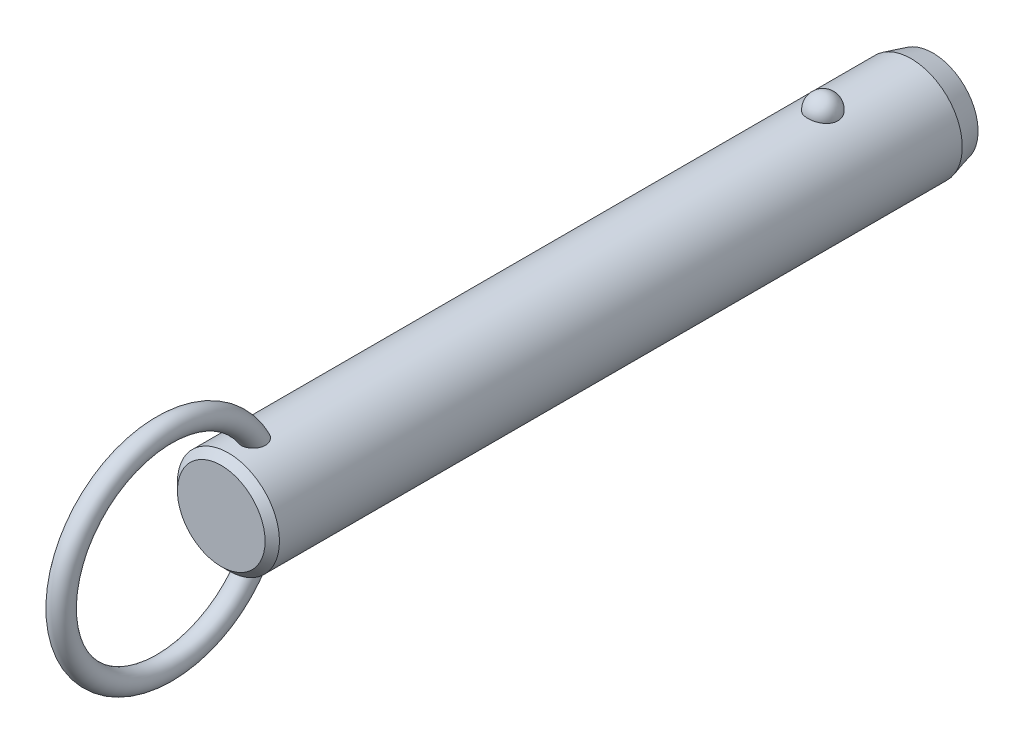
ISO-10303-21;
HEADER;
FILE_DESCRIPTION(('STEP AP214'),'2;1');
FILE_NAME('part.step','',(''),(''),'','','');
FILE_SCHEMA(('AUTOMOTIVE_DESIGN { 1 0 10303 214 1 1 1 1 }'));
ENDSEC;
DATA;
#1=APPLICATION_CONTEXT('core data for automotive mechanical design processes');
#2=APPLICATION_PROTOCOL_DEFINITION('international standard','automotive_design',2000,#1);
#3=PRODUCT_CONTEXT('',#1,'mechanical');
#4=PRODUCT('Part','Part','',(#3));
#5=PRODUCT_RELATED_PRODUCT_CATEGORY('part','',(#4));
#6=PRODUCT_DEFINITION_FORMATION('','',#4);
#7=PRODUCT_DEFINITION_CONTEXT('part definition',#1,'design');
#8=PRODUCT_DEFINITION('design','',#6,#7);
#9=PRODUCT_DEFINITION_SHAPE('','',#8);
#10=(LENGTH_UNIT() NAMED_UNIT(*) SI_UNIT(.MILLI.,.METRE.));
#11=(NAMED_UNIT(*) PLANE_ANGLE_UNIT() SI_UNIT($,.RADIAN.));
#12=(NAMED_UNIT(*) SI_UNIT($,.STERADIAN.) SOLID_ANGLE_UNIT());
#13=UNCERTAINTY_MEASURE_WITH_UNIT(LENGTH_MEASURE(1.E-05),#10,'distance_accuracy_value','');
#14=(GEOMETRIC_REPRESENTATION_CONTEXT(3) GLOBAL_UNCERTAINTY_ASSIGNED_CONTEXT((#13)) GLOBAL_UNIT_ASSIGNED_CONTEXT((#10,
#11,#12)) REPRESENTATION_CONTEXT('',''));
#15=CARTESIAN_POINT('',(0.,0.,0.));
#16=DIRECTION('',(0.,0.,1.));
#17=DIRECTION('',(1.,0.,0.));
#18=AXIS2_PLACEMENT_3D('',#15,#16,#17);
#19=CARTESIAN_POINT('',(0.,0.,73.7));
#20=DIRECTION('',(0.,0.,-1.));
#21=DIRECTION('',(-1.,0.,0.));
#22=AXIS2_PLACEMENT_3D('',#19,#20,#21);
#23=CYLINDRICAL_SURFACE('',#22,7.1);
#24=CARTESIAN_POINT('',(2.0769088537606,6.78943661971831,-2.1));
#25=CARTESIAN_POINT('',(2.07690739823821,6.78943796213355,-1.98268154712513));
#26=CARTESIAN_POINT('',(2.06738130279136,6.79237331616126,-1.86534506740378));
#27=CARTESIAN_POINT('',(2.0295040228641,6.8037853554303,-1.63400788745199));
#28=CARTESIAN_POINT('',(2.00114757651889,6.81226358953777,-1.52000812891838));
#29=CARTESIAN_POINT('',(1.92632025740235,6.83379798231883,-1.29863433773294));
#30=CARTESIAN_POINT('',(1.87985726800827,6.84685214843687,-1.19125744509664));
#31=CARTESIAN_POINT('',(1.76995205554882,6.87608091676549,-0.98604657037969));
#32=CARTESIAN_POINT('',(1.70650980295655,6.8922555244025,-0.88821260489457));
#33=CARTESIAN_POINT('',(1.5638119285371,6.92602930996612,-0.704242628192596));
#34=CARTESIAN_POINT('',(1.4844714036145,6.94363582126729,-0.618173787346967));
#35=CARTESIAN_POINT('',(1.31221746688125,6.97823658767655,-0.460740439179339));
#36=CARTESIAN_POINT('',(1.21930409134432,6.99523084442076,-0.389375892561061));
#37=CARTESIAN_POINT('',(1.02268781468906,7.02666176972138,-0.263547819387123));
#38=CARTESIAN_POINT('',(0.91902009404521,7.04110638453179,-0.209031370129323));
#39=CARTESIAN_POINT('',(0.703548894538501,7.06588726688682,-0.118163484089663));
#40=CARTESIAN_POINT('',(0.591746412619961,7.07622403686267,-0.0818098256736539));
#41=CARTESIAN_POINT('',(0.365557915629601,7.09147068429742,-0.0288711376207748));
#42=CARTESIAN_POINT('',(0.251267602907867,7.09648447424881,-0.0119070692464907));
#43=CARTESIAN_POINT('',(0.0213499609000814,7.10089837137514,0.00304925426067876));
#44=CARTESIAN_POINT('',(-0.0942772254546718,7.10029907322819,0.00104351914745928));
#45=CARTESIAN_POINT('',(-0.321651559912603,7.09360829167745,-0.0216931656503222));
#46=CARTESIAN_POINT('',(-0.433431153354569,7.08760388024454,-0.0421272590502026));
#47=CARTESIAN_POINT('',(-0.651862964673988,7.07086131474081,-0.100729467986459));
#48=CARTESIAN_POINT('',(-0.758515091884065,7.06012307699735,-0.138897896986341));
#49=CARTESIAN_POINT('',(-0.964449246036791,7.03496097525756,-0.232213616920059));
#50=CARTESIAN_POINT('',(-1.06368095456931,7.02051445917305,-0.287465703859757));
#51=CARTESIAN_POINT('',(-1.25145353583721,6.98948740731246,-0.413383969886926));
#52=CARTESIAN_POINT('',(-1.33999321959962,6.97290663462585,-0.48405186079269));
#53=CARTESIAN_POINT('',(-1.50591604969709,6.93898770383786,-0.640594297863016));
#54=CARTESIAN_POINT('',(-1.58302488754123,6.92164094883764,-0.726757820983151));
#55=CARTESIAN_POINT('',(-1.72189320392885,6.8884103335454,-0.91092752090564));
#56=CARTESIAN_POINT('',(-1.78365144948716,6.87252659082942,-1.008934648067));
#57=CARTESIAN_POINT('',(-1.89101272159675,6.84377189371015,-1.21549497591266));
#58=CARTESIAN_POINT('',(-1.93639553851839,6.83094274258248,-1.32416860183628));
#59=CARTESIAN_POINT('',(-2.00874275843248,6.81002070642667,-1.54791500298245));
#60=CARTESIAN_POINT('',(-2.03570774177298,6.80192767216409,-1.66298757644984));
#61=CARTESIAN_POINT('',(-2.07047276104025,6.7914266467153,-1.89571453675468));
#62=CARTESIAN_POINT('',(-2.07835878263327,6.78899315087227,-2.01335491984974));
#63=CARTESIAN_POINT('',(-2.07502083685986,6.79001409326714,-2.24833570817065));
#64=CARTESIAN_POINT('',(-2.06379746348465,6.7934683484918,-2.36567612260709));
#65=CARTESIAN_POINT('',(-2.02263913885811,6.80583442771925,-2.59603194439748));
#66=CARTESIAN_POINT('',(-1.99281127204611,6.81471501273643,-2.70906820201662));
#67=CARTESIAN_POINT('',(-1.91526639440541,6.83691232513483,-2.92836575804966));
#68=CARTESIAN_POINT('',(-1.8675486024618,6.85022924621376,-3.03462676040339));
#69=CARTESIAN_POINT('',(-1.75504492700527,6.87991336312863,-3.23806487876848));
#70=CARTESIAN_POINT('',(-1.69015924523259,6.89629822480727,-3.33518422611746));
#71=CARTESIAN_POINT('',(-1.54505404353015,6.93024852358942,-3.51697105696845));
#72=CARTESIAN_POINT('',(-1.46483385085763,6.94781401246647,-3.60163799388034));
#73=CARTESIAN_POINT('',(-1.29071406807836,6.98225977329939,-3.75654119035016));
#74=CARTESIAN_POINT('',(-1.19675650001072,6.99913673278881,-3.82671308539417));
#75=CARTESIAN_POINT('',(-0.997940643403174,7.03023618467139,-3.9501837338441));
#76=CARTESIAN_POINT('',(-0.89308318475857,7.04445887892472,-4.00348377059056));
#77=CARTESIAN_POINT('',(-0.676902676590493,7.06848365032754,-4.09107242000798));
#78=CARTESIAN_POINT('',(-0.565686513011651,7.0783430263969,-4.12560889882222));
#79=CARTESIAN_POINT('',(-0.338739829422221,7.09282534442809,-4.17575450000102));
#80=CARTESIAN_POINT('',(-0.223009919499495,7.09744899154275,-4.19136617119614));
#81=CARTESIAN_POINT('',(0.00707628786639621,7.10090930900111,-4.20307965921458));
#82=CARTESIAN_POINT('',(0.121410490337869,7.09986531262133,-4.19958377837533));
#83=CARTESIAN_POINT('',(0.347815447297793,7.092380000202,-4.17411564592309));
#84=CARTESIAN_POINT('',(0.459886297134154,7.08593891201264,-4.15214417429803));
#85=CARTESIAN_POINT('',(0.678084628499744,7.06838983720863,-4.09049562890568));
#86=CARTESIAN_POINT('',(0.784237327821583,7.05730369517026,-4.05090137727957));
#87=CARTESIAN_POINT('',(0.988305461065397,7.03163139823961,-3.95511447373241));
#88=CARTESIAN_POINT('',(1.08622031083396,7.01704499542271,-3.89892064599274));
#89=CARTESIAN_POINT('',(1.27284490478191,6.98562668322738,-3.77035541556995));
#90=CARTESIAN_POINT('',(1.36137372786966,6.96876135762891,-3.69772964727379));
#91=CARTESIAN_POINT('',(1.52509486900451,6.93477412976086,-3.53878279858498));
#92=CARTESIAN_POINT('',(1.60028496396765,6.91765218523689,-3.45245943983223));
#93=CARTESIAN_POINT('',(1.73681688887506,6.88465753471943,-3.26658774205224));
#94=CARTESIAN_POINT('',(1.79785966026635,6.86881574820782,-3.16681408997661));
#95=CARTESIAN_POINT('',(1.90265327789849,6.84053157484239,-2.95814408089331));
#96=CARTESIAN_POINT('',(1.94640861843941,6.82808830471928,-2.84925010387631));
#97=CARTESIAN_POINT('',(2.01274378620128,6.80881460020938,-2.63454318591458));
#98=CARTESIAN_POINT('',(2.03676193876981,6.80160856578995,-2.52920574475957));
#99=CARTESIAN_POINT('',(2.06884490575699,6.79191902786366,-2.3159172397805));
#100=CARTESIAN_POINT('',(2.07691019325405,6.78943538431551,-2.20796625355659));
#101=CARTESIAN_POINT('',(2.0769088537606,6.78943661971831,-2.1));
#102=B_SPLINE_CURVE_WITH_KNOTS('',3,(#24,#25,#26,#27,#28,#29,#30,#31,#32,#33,#34,#35,#36,#37,
#38,#39,#40,#41,#42,#43,#44,#45,#46,#47,#48,#49,#50,#51,#52,#53,#54,#55,#56,#57,#58,#59,#60,#61,
#62,#63,#64,#65,#66,#67,#68,#69,#70,#71,#72,#73,#74,#75,#76,#77,#78,#79,#80,#81,#82,#83,#84,#85,
#86,#87,#88,#89,#90,#91,#92,#93,#94,#95,#96,#97,#98,#99,#100,#101),.UNSPECIFIED.,.T.,.F.,(4,2,2,
2,2,2,2,2,2,2,2,2,2,2,2,2,2,2,2,2,2,2,2,2,2,2,2,2,2,2,2,2,2,2,2,2,2,2,4),(0.,0.351568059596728,
0.703234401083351,1.05474780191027,1.40626181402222,1.75970563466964,2.11314851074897,
2.4654696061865,2.81774759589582,3.16301449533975,3.50824481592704,3.84801136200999,
4.18778391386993,4.52968352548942,4.87162112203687,5.22076181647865,5.56993054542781,
5.92363364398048,6.27732559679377,6.62942052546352,6.98150450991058,7.33158042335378,
7.68167162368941,8.03384443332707,8.38603269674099,8.73975272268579,9.09344583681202,
9.44234545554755,9.79119807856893,10.1327344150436,10.4742563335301,10.8141898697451,
11.1541474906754,11.4997793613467,11.8454687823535,12.1979079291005,12.5502553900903,
12.8738073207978,13.1973496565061),.UNSPECIFIED.);
#103=CARTESIAN_POINT('',(2.0769088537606,6.78943661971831,-2.1));
#104=VERTEX_POINT('',#103);
#105=EDGE_CURVE('E41',#104,#104,#102,.T.);
#106=ORIENTED_EDGE('',*,*,#105,.T.);
#107=EDGE_LOOP('',(#106));
#108=FACE_BOUND('',#107,.T.);
#109=CARTESIAN_POINT('',(0.,0.,80.62));
#110=DIRECTION('',(0.,0.,1.));
#111=DIRECTION('',(1.,0.,0.));
#112=AXIS2_PLACEMENT_3D('',#109,#110,#111);
#113=CIRCLE('',#112,7.1);
#114=CARTESIAN_POINT('',(7.1,0.,80.62));
#115=VERTEX_POINT('',#114);
#116=EDGE_CURVE('E10',#115,#115,#113,.F.);
#117=ORIENTED_EDGE('',*,*,#116,.T.);
#118=EDGE_LOOP('',(#117));
#119=FACE_BOUND('',#118,.T.);
#120=CARTESIAN_POINT('',(-0.429539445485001,-7.08699541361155,75.4429212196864));
#121=CARTESIAN_POINT('',(-0.508331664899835,-7.08221999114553,75.4668764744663));
#122=CARTESIAN_POINT('',(-0.585039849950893,-7.07624016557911,75.4974570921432));
#123=CARTESIAN_POINT('',(-0.732082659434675,-7.06254296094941,75.5710242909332));
#124=CARTESIAN_POINT('',(-0.802417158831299,-7.05482554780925,75.6140111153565));
#125=CARTESIAN_POINT('',(-0.934722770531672,-7.03851844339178,75.7111135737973));
#126=CARTESIAN_POINT('',(-0.996700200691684,-7.02992941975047,75.7652207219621));
#127=CARTESIAN_POINT('',(-1.11079942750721,-7.01280697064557,75.8829676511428));
#128=CARTESIAN_POINT('',(-1.16292136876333,-7.00427354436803,75.9466072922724));
#129=CARTESIAN_POINT('',(-1.25705660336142,-6.98799959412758,76.0826870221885));
#130=CARTESIAN_POINT('',(-1.2988803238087,-6.98027525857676,76.1552598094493));
#131=CARTESIAN_POINT('',(-1.37069920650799,-6.96652886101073,76.3061686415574));
#132=CARTESIAN_POINT('',(-1.40069157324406,-6.96050720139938,76.3845060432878));
#133=CARTESIAN_POINT('',(-1.45043507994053,-6.95031881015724,76.5501903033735));
#134=CARTESIAN_POINT('',(-1.46937115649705,-6.94630231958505,76.6377897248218));
#135=CARTESIAN_POINT('',(-1.49424917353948,-6.94099239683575,76.8148714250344));
#136=CARTESIAN_POINT('',(-1.50018601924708,-6.93970003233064,76.9043544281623));
#137=CARTESIAN_POINT('',(-1.49978214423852,-6.93978815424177,77.0940607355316));
#138=CARTESIAN_POINT('',(-1.49187639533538,-6.94150934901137,77.194279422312));
#139=CARTESIAN_POINT('',(-1.46177925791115,-6.94790814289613,77.3924798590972));
#140=CARTESIAN_POINT('',(-1.43957541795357,-6.95258831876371,77.490459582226));
#141=CARTESIAN_POINT('',(-1.37783293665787,-6.96510647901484,77.6953629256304));
#142=CARTESIAN_POINT('',(-1.33634073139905,-6.97328848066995,77.8016801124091));
#143=CARTESIAN_POINT('',(-1.23686994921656,-6.99161706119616,78.0061777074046));
#144=CARTESIAN_POINT('',(-1.17889192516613,-7.00176357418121,78.1043583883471));
#145=CARTESIAN_POINT('',(-1.0587512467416,-7.02082898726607,78.2723743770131));
#146=CARTESIAN_POINT('',(-0.999247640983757,-7.02963746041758,78.3441230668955));
#147=CARTESIAN_POINT('',(-0.869494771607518,-7.04686074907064,78.4771959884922));
#148=CARTESIAN_POINT('',(-0.79926347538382,-7.05527619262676,78.5385372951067));
#149=CARTESIAN_POINT('',(-0.665408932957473,-7.06899457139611,78.6351316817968));
#150=CARTESIAN_POINT('',(-0.603817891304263,-7.07457275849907,78.6731512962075));
#151=CARTESIAN_POINT('',(-0.475172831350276,-7.08437420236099,78.7387581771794));
#152=CARTESIAN_POINT('',(-0.408123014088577,-7.08859848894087,78.7663533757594));
#153=CARTESIAN_POINT('',(-0.269431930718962,-7.09522749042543,78.8092569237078));
#154=CARTESIAN_POINT('',(-0.197757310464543,-7.09761688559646,78.8244618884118));
#155=CARTESIAN_POINT('',(-0.0527849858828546,-7.10017268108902,78.8407168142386));
#156=CARTESIAN_POINT('',(0.0205115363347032,-7.10034065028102,78.8417767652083));
#157=CARTESIAN_POINT('',(0.156426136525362,-7.09855986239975,78.8304619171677));
#158=CARTESIAN_POINT('',(0.219199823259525,-7.09688191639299,78.8198060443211));
#159=CARTESIAN_POINT('',(0.342134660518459,-7.09201880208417,78.7885379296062));
#160=CARTESIAN_POINT('',(0.402295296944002,-7.08883333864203,78.7679237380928));
#161=CARTESIAN_POINT('',(0.52068738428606,-7.08113868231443,78.7172125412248));
#162=CARTESIAN_POINT('',(0.578791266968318,-7.07658958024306,78.6868272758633));
#163=CARTESIAN_POINT('',(0.690173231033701,-7.06659708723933,78.6183678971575));
#164=CARTESIAN_POINT('',(0.743447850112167,-7.061153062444,78.5802883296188));
#165=CARTESIAN_POINT('',(0.870947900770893,-7.04680292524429,78.4765929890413));
#166=CARTESIAN_POINT('',(0.941828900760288,-7.0375580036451,78.4068972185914));
#167=CARTESIAN_POINT('',(1.07136606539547,-7.01900793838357,78.2569450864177));
#168=CARTESIAN_POINT('',(1.13000013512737,-7.00970271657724,78.1766700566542));
#169=CARTESIAN_POINT('',(1.23579584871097,-6.99183327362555,78.0068997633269));
#170=CARTESIAN_POINT('',(1.28274271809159,-6.98328455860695,77.9172696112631));
#171=CARTESIAN_POINT('',(1.36351442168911,-6.96796352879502,77.7321763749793));
#172=CARTESIAN_POINT('',(1.39733971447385,-6.96119115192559,77.6367134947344));
#173=CARTESIAN_POINT('',(1.45579181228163,-6.94922464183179,77.4253092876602));
#174=CARTESIAN_POINT('',(1.47790145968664,-6.94449000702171,77.308631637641));
#175=CARTESIAN_POINT('',(1.50168752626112,-6.93938731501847,77.0730153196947));
#176=CARTESIAN_POINT('',(1.50336085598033,-6.93901991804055,76.95407631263));
#177=CARTESIAN_POINT('',(1.48486516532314,-6.9430010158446,76.7236079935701));
#178=CARTESIAN_POINT('',(1.46573441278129,-6.9471253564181,76.6119958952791));
#179=CARTESIAN_POINT('',(1.40606892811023,-6.95944667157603,76.3948868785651));
#180=CARTESIAN_POINT('',(1.3655644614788,-6.96763788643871,76.2893815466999));
#181=CARTESIAN_POINT('',(1.27082700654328,-6.98548038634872,76.1042879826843));
#182=CARTESIAN_POINT('',(1.21949810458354,-6.99473841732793,76.0231719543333));
#183=CARTESIAN_POINT('',(1.10242050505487,-7.01414069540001,75.8722278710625));
#184=CARTESIAN_POINT('',(1.03668119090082,-7.02428436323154,75.8023925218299));
#185=CARTESIAN_POINT('',(0.900559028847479,-7.04295285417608,75.6835735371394));
#186=CARTESIAN_POINT('',(0.831428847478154,-7.05153466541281,75.6331573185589));
#187=CARTESIAN_POINT('',(0.685291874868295,-7.06723150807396,75.5451429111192));
#188=CARTESIAN_POINT('',(0.608287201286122,-7.0743469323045,75.5075412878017));
#189=CARTESIAN_POINT('',(0.451878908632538,-7.08602232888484,75.4474915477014));
#190=CARTESIAN_POINT('',(0.372686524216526,-7.09067127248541,75.4245088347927));
#191=CARTESIAN_POINT('',(0.211477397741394,-7.09730788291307,75.3920357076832));
#192=CARTESIAN_POINT('',(0.12946098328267,-7.09929585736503,75.3825437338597));
#193=CARTESIAN_POINT('',(-0.0332905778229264,-7.10037858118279,75.3773517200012));
#194=CARTESIAN_POINT('',(-0.114016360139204,-7.09953334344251,75.3813656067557));
#195=CARTESIAN_POINT('',(-0.273670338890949,-7.09517338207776,75.4024540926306));
#196=CARTESIAN_POINT('',(-0.352598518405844,-7.09165863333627,75.4195288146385));
#197=CARTESIAN_POINT('',(-0.429539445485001,-7.08699541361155,75.4429212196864));
#198=B_SPLINE_CURVE_WITH_KNOTS('',3,(#120,#121,#122,#123,#124,#125,#126,#127,#128,#129,#130,
#131,#132,#133,#134,#135,#136,#137,#138,#139,#140,#141,#142,#143,#144,#145,#146,#147,#148,#149,
#150,#151,#152,#153,#154,#155,#156,#157,#158,#159,#160,#161,#162,#163,#164,#165,#166,#167,#168,
#169,#170,#171,#172,#173,#174,#175,#176,#177,#178,#179,#180,#181,#182,#183,#184,#185,#186,#187,
#188,#189,#190,#191,#192,#193,#194,#195,#196,#197),.UNSPECIFIED.,.T.,.F.,(4,2,2,2,2,2,2,2,2,2,2,
2,2,2,2,2,2,2,2,2,2,2,2,2,2,2,2,2,2,2,2,2,2,2,2,2,2,2,4),(0.,0.247183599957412,0.49437204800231,
0.741372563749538,0.988369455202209,1.23962059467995,1.49093106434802,1.75897818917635,
2.02713035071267,2.32758265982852,2.62829697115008,2.97008736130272,3.31186629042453,
3.5917531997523,3.87117637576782,4.08813841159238,4.30493502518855,4.52352259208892,
4.74195577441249,4.93215328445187,5.12238804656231,5.31884850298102,5.51544871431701,
5.81332317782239,6.11173048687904,6.41527266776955,6.71880423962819,7.07358156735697,
7.42841252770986,7.76631485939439,8.10373999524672,8.39142246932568,8.67891817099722,
8.93560332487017,9.19221962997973,9.43881106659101,9.68537399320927,9.92674752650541,
10.1681233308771),.UNSPECIFIED.);
#199=CARTESIAN_POINT('',(-0.429539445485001,-7.08699541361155,75.4429212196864));
#200=VERTEX_POINT('',#199);
#201=EDGE_CURVE('E60',#200,#200,#198,.T.);
#202=ORIENTED_EDGE('',*,*,#201,.T.);
#203=EDGE_LOOP('',(#202));
#204=FACE_BOUND('',#203,.T.);
#205=CARTESIAN_POINT('',(-0.429539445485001,7.08699541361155,75.4429212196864));
#206=CARTESIAN_POINT('',(-0.351665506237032,7.09171429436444,75.4192469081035));
#207=CARTESIAN_POINT('',(-0.271733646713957,7.09525896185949,75.4020369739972));
#208=CARTESIAN_POINT('',(-0.110026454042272,7.09960839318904,75.3810059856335));
#209=CARTESIAN_POINT('',(-0.0282502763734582,7.10041187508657,75.377191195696));
#210=CARTESIAN_POINT('',(0.134782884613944,7.09918849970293,75.383059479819));
#211=CARTESIAN_POINT('',(0.216039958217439,7.09716214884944,75.3927401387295));
#212=CARTESIAN_POINT('',(0.375730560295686,7.09050177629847,75.4253471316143));
#213=CARTESIAN_POINT('',(0.454164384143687,7.08586802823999,75.4482720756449));
#214=CARTESIAN_POINT('',(0.606025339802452,7.07449911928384,75.506771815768));
#215=CARTESIAN_POINT('',(0.679451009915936,7.06776334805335,75.5423502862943));
#216=CARTESIAN_POINT('',(0.819234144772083,7.05292866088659,75.6251753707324));
#217=CARTESIAN_POINT('',(0.885591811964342,7.04482978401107,75.6724216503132));
#218=CARTESIAN_POINT('',(1.00993211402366,7.02808709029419,75.7775902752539));
#219=CARTESIAN_POINT('',(1.06785399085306,7.01943990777,75.835583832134));
#220=CARTESIAN_POINT('',(1.17342527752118,7.00256662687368,75.9603013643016));
#221=CARTESIAN_POINT('',(1.22107408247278,6.99434055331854,76.0270258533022));
#222=CARTESIAN_POINT('',(1.30652927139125,6.97889183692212,76.1693622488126));
#223=CARTESIAN_POINT('',(1.34399711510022,6.97170674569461,76.2451808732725));
#224=CARTESIAN_POINT('',(1.40682616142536,6.95930080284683,76.4018100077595));
#225=CARTESIAN_POINT('',(1.43218374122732,6.95408053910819,76.4826220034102));
#226=CARTESIAN_POINT('',(1.47246409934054,6.94566853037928,76.6535314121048));
#227=CARTESIAN_POINT('',(1.48642590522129,6.9426653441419,76.7438630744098));
#228=CARTESIAN_POINT('',(1.5011410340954,6.93949744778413,76.925619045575));
#229=CARTESIAN_POINT('',(1.50188917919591,6.93933385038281,77.0170437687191));
#230=CARTESIAN_POINT('',(1.49030464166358,6.94183245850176,77.2108438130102));
#231=CARTESIAN_POINT('',(1.47627413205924,6.94486147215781,77.313112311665));
#232=CARTESIAN_POINT('',(1.43356351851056,6.95380194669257,77.5144719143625));
#233=CARTESIAN_POINT('',(1.4048676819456,6.95971650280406,77.6135594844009));
#234=CARTESIAN_POINT('',(1.32908750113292,6.97461208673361,77.8189087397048));
#235=CARTESIAN_POINT('',(1.28011435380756,6.98388945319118,77.9244566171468));
#236=CARTESIAN_POINT('',(1.16520357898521,7.00397743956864,78.1257604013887));
#237=CARTESIAN_POINT('',(1.09927694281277,7.01478706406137,78.2215225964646));
#238=CARTESIAN_POINT('',(0.969361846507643,7.03373936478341,78.3767565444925));
#239=CARTESIAN_POINT('',(0.909042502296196,7.04187023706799,78.4393032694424));
#240=CARTESIAN_POINT('',(0.779178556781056,7.05741732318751,78.5540535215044));
#241=CARTESIAN_POINT('',(0.709649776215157,7.06483472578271,78.6062744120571));
#242=CARTESIAN_POINT('',(0.576854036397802,7.0767751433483,78.6881138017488));
#243=CARTESIAN_POINT('',(0.515118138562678,7.08158033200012,78.7201641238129));
#244=CARTESIAN_POINT('',(0.387127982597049,7.08972701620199,78.7737656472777));
#245=CARTESIAN_POINT('',(0.320877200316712,7.09306962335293,78.7953248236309));
#246=CARTESIAN_POINT('',(0.185041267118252,7.09791507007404,78.8264005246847));
#247=CARTESIAN_POINT('',(0.115437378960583,7.09940591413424,78.8358385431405));
#248=CARTESIAN_POINT('',(-0.0243157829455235,7.10030171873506,78.8415226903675));
#249=CARTESIAN_POINT('',(-0.0944648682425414,7.0997073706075,78.8377731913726));
#250=CARTESIAN_POINT('',(-0.225713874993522,7.09668414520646,78.8185081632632));
#251=CARTESIAN_POINT('',(-0.28700675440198,7.09444865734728,78.8042323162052));
#252=CARTESIAN_POINT('',(-0.406555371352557,7.08860360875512,78.7663685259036));
#253=CARTESIAN_POINT('',(-0.464809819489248,7.08499346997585,78.7427766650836));
#254=CARTESIAN_POINT('',(-0.594955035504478,7.07541654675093,78.6789232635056));
#255=CARTESIAN_POINT('',(-0.665389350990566,7.06906574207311,78.635753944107));
#256=CARTESIAN_POINT('',(-0.798242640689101,7.05530261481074,78.538587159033));
#257=CARTESIAN_POINT('',(-0.860645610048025,7.0478882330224,78.4845686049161));
#258=CARTESIAN_POINT('',(-0.994249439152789,7.03045217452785,78.3509965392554));
#259=CARTESIAN_POINT('',(-1.06260129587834,7.02030745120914,78.2686143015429));
#260=CARTESIAN_POINT('',(-1.18502045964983,7.00068382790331,78.093843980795));
#261=CARTESIAN_POINT('',(-1.23907684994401,6.99120544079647,78.001448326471));
#262=CARTESIAN_POINT('',(-1.33335589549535,6.97384343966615,77.8080085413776));
#263=CARTESIAN_POINT('',(-1.3733613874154,6.96598557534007,77.7068564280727));
#264=CARTESIAN_POINT('',(-1.43770677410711,6.9529905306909,77.4995046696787));
#265=CARTESIAN_POINT('',(-1.46204473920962,6.94785368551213,77.39330440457));
#266=CARTESIAN_POINT('',(-1.49537533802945,6.94076296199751,77.1682317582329));
#267=CARTESIAN_POINT('',(-1.50273564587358,6.93914842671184,77.0490975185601));
#268=CARTESIAN_POINT('',(-1.4954555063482,6.94072368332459,76.8114703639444));
#269=CARTESIAN_POINT('',(-1.48082914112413,6.94391040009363,76.6929770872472));
#270=CARTESIAN_POINT('',(-1.43076401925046,6.95438579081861,76.4734325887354));
#271=CARTESIAN_POINT('',(-1.39762227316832,6.96121852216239,76.3718413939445));
#272=CARTESIAN_POINT('',(-1.31211274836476,6.97783941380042,76.1773513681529));
#273=CARTESIAN_POINT('',(-1.2597660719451,6.98762432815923,76.0844431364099));
#274=CARTESIAN_POINT('',(-1.14583073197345,7.00713153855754,75.9241601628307));
#275=CARTESIAN_POINT('',(-1.08665947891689,7.01665982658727,75.8550351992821));
#276=CARTESIAN_POINT('',(-0.956606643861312,7.03556646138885,75.7288786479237));
#277=CARTESIAN_POINT('',(-0.885737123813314,7.04494495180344,75.6718347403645));
#278=CARTESIAN_POINT('',(-0.751558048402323,7.06035735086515,75.5831004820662));
#279=CARTESIAN_POINT('',(-0.690120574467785,7.0666695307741,75.5485932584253));
#280=CARTESIAN_POINT('',(-0.562815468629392,7.07794609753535,75.4887507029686));
#281=CARTESIAN_POINT('',(-0.496948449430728,7.08291067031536,75.4634141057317));
#282=CARTESIAN_POINT('',(-0.429539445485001,7.08699541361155,75.4429212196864));
#283=B_SPLINE_CURVE_WITH_KNOTS('',3,(#205,#206,#207,#208,#209,#210,#211,#212,#213,#214,#215,
#216,#217,#218,#219,#220,#221,#222,#223,#224,#225,#226,#227,#228,#229,#230,#231,#232,#233,#234,
#235,#236,#237,#238,#239,#240,#241,#242,#243,#244,#245,#246,#247,#248,#249,#250,#251,#252,#253,
#254,#255,#256,#257,#258,#259,#260,#261,#262,#263,#264,#265,#266,#267,#268,#269,#270,#271,#272,
#273,#274,#275,#276,#277,#278,#279,#280,#281,#282),.UNSPECIFIED.,.T.,.F.,(4,2,2,2,2,2,2,2,2,2,2,
2,2,2,2,2,2,2,2,2,2,2,2,2,2,2,2,2,2,2,2,2,2,2,2,2,2,2,4),(0.,0.244335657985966,
0.488785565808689,0.733191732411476,0.977572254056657,1.22202379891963,1.46646834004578,
1.71259457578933,1.95873529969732,2.21226768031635,2.46587585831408,2.73913816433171,
3.01250754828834,3.32109936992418,3.63002293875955,3.97863512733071,4.32702187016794,
4.58793945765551,4.84841449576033,5.05676704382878,5.26496096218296,5.47449661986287,
5.68396281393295,5.87205447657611,6.06022532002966,6.30743751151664,6.55513496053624,
6.87602468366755,7.19715875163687,7.52305774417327,7.84899686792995,8.20516155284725,
8.56109821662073,8.88040084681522,9.19935367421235,9.47236282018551,9.74509220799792,
9.9566225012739,10.1681235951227),.UNSPECIFIED.);
#284=CARTESIAN_POINT('',(-0.429539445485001,7.08699541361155,75.4429212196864));
#285=VERTEX_POINT('',#284);
#286=EDGE_CURVE('E67',#285,#285,#283,.T.);
#287=ORIENTED_EDGE('',*,*,#286,.T.);
#288=EDGE_LOOP('',(#287));
#289=FACE_BOUND('',#288,.T.);
#290=CARTESIAN_POINT('',(0.,0.,-14.4));
#291=DIRECTION('',(0.,0.,-1.));
#292=DIRECTION('',(-1.,0.,0.));
#293=AXIS2_PLACEMENT_3D('',#290,#291,#292);
#294=CIRCLE('',#293,7.1);
#295=CARTESIAN_POINT('',(-7.1,0.,-14.4));
#296=VERTEX_POINT('',#295);
#297=EDGE_CURVE('E57',#296,#296,#294,.F.);
#298=ORIENTED_EDGE('',*,*,#297,.T.);
#299=EDGE_LOOP('',(#298));
#300=FACE_BOUND('',#299,.T.);
#301=ADVANCED_FACE('F37',(#108,#119,#204,#289,#300),#23,.T.);
#302=CARTESIAN_POINT('',(0.,0.,-17.4));
#303=DIRECTION('',(0.,0.,-1.));
#304=DIRECTION('',(-1.,0.,0.));
#305=AXIS2_PLACEMENT_3D('',#302,#303,#304);
#306=PLANE('',#305);
#307=CARTESIAN_POINT('',(0.,0.,-17.4));
#308=DIRECTION('',(0.,0.,-1.));
#309=DIRECTION('',(-1.,0.,0.));
#310=AXIS2_PLACEMENT_3D('',#307,#308,#309);
#311=CIRCLE('',#310,6.29615242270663);
#312=CARTESIAN_POINT('',(-6.29615242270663,0.,-17.4));
#313=VERTEX_POINT('',#312);
#314=EDGE_CURVE('E66',#313,#313,#311,.T.);
#315=ORIENTED_EDGE('',*,*,#314,.T.);
#316=EDGE_LOOP('',(#315));
#317=FACE_BOUND('',#316,.T.);
#318=ADVANCED_FACE('F85',(#317),#306,.T.);
#319=CARTESIAN_POINT('',(0.,0.,-17.4));
#320=DIRECTION('',(0.,0.,1.));
#321=DIRECTION('',(1.,0.,0.));
#322=AXIS2_PLACEMENT_3D('',#319,#320,#321);
#323=CONICAL_SURFACE('',#322,6.29615242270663,0.261799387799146);
#324=ORIENTED_EDGE('',*,*,#297,.F.);
#325=EDGE_LOOP('',(#324));
#326=FACE_BOUND('',#325,.T.);
#327=ORIENTED_EDGE('',*,*,#314,.F.);
#328=EDGE_LOOP('',(#327));
#329=FACE_BOUND('',#328,.T.);
#330=ADVANCED_FACE('F83',(#326,#329),#323,.T.);
#331=CARTESIAN_POINT('',(0.,0.,81.62));
#332=DIRECTION('',(0.,0.,1.));
#333=DIRECTION('',(1.,0.,0.));
#334=AXIS2_PLACEMENT_3D('',#331,#332,#333);
#335=PLANE('',#334);
#336=CARTESIAN_POINT('',(0.,0.,81.62));
#337=DIRECTION('',(0.,0.,1.));
#338=DIRECTION('',(1.,0.,0.));
#339=AXIS2_PLACEMENT_3D('',#336,#337,#338);
#340=CIRCLE('',#339,6.10000000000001);
#341=CARTESIAN_POINT('',(6.10000000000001,0.,81.62));
#342=VERTEX_POINT('',#341);
#343=EDGE_CURVE('E50',#342,#342,#340,.T.);
#344=ORIENTED_EDGE('',*,*,#343,.T.);
#345=EDGE_LOOP('',(#344));
#346=FACE_BOUND('',#345,.T.);
#347=ADVANCED_FACE('F77',(#346),#335,.T.);
#348=CARTESIAN_POINT('',(0.,0.,89.55));
#349=DIRECTION('',(1.,0.,0.));
#350=DIRECTION('',(0.,0.,-1.));
#351=AXIS2_PLACEMENT_3D('',#348,#349,#350);
#352=TOROIDAL_SURFACE('',#351,14.35,1.5);
#353=ORIENTED_EDGE('',*,*,#286,.F.);
#354=EDGE_LOOP('',(#353));
#355=FACE_BOUND('',#354,.T.);
#356=ORIENTED_EDGE('',*,*,#201,.F.);
#357=EDGE_LOOP('',(#356));
#358=FACE_BOUND('',#357,.T.);
#359=ADVANCED_FACE('F73',(#355,#358),#352,.T.);
#360=CARTESIAN_POINT('',(0.,0.,81.62));
#361=DIRECTION('',(0.,0.,-1.));
#362=DIRECTION('',(-1.,0.,0.));
#363=AXIS2_PLACEMENT_3D('',#360,#361,#362);
#364=CONICAL_SURFACE('',#363,6.10000000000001,0.78539816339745);
#365=ORIENTED_EDGE('',*,*,#116,.F.);
#366=EDGE_LOOP('',(#365));
#367=FACE_BOUND('',#366,.T.);
#368=ORIENTED_EDGE('',*,*,#343,.F.);
#369=EDGE_LOOP('',(#368));
#370=FACE_BOUND('',#369,.T.);
#371=ADVANCED_FACE('F39',(#367,#370),#364,.T.);
#372=CARTESIAN_POINT('',(0.,7.1,-2.1));
#373=DIRECTION('',(0.,1.,0.));
#374=DIRECTION('',(0.,0.,1.));
#375=AXIS2_PLACEMENT_3D('',#372,#373,#374);
#376=SPHERICAL_SURFACE('',#375,2.10000000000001);
#377=ORIENTED_EDGE('',*,*,#105,.F.);
#378=EDGE_LOOP('',(#377));
#379=FACE_BOUND('',#378,.T.);
#380=ADVANCED_FACE('F79',(#379),#376,.T.);
#381=CLOSED_SHELL('',(#301,#318,#330,#347,#359,#371,#380));
#382=MANIFOLD_SOLID_BREP('B2',#381);
#383=ADVANCED_BREP_SHAPE_REPRESENTATION('',(#18,#382),#14);
#384=SHAPE_DEFINITION_REPRESENTATION(#9,#383);
ENDSEC;
END-ISO-10303-21;
